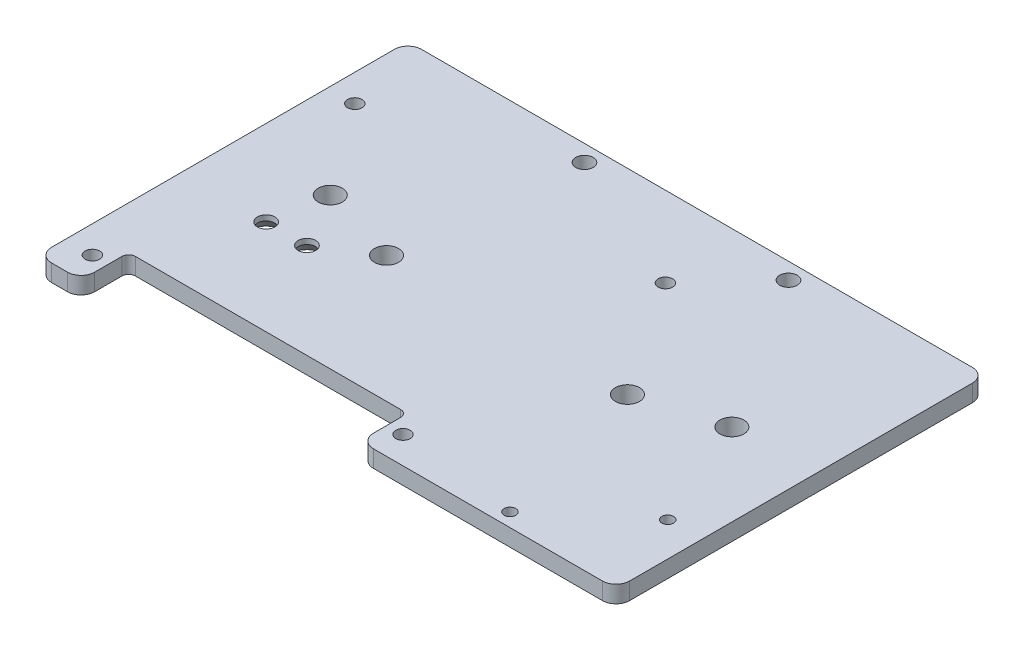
from build123d import *

# Parameters (mm, degrees)
SKETCH1_W                                     = 107.95
SKETCH1_H                                     = 69.088
BOSS_EXTRUDE1_DEPTH                           = 3.175
SKETCH2_R                                     = 1.63195
SKETCH2_R_2                                   = 1.35
SKETCH2_R_3                                   = 2.25
SKETCH2_R_4                                   = 0.635
SKETCH2_R_5                                   = 1.09
SKETCH2_W                                     = 52.070014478
SKETCH2_H                                     = 8.89
CUT_EXTRUDE1_DEPTH                            = 129.204660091
FILLET1_R                                     = 2.54
FILLET2_R                                     = 2.54
FILLET3_R                                     = 2.54
FILLET4_R                                     = 2.54
FILLET5_R                                     = 2.54
FILLET12_R                                    = 1.27
FILLET11_R                                    = 1.27
FILLET8_R                                     = 2.54
CSK_FOR_4_FLAT_HEAD_MACHINE_SCREW1_AT_2_COUNT = 2
CSK_FOR_4_FLAT_HEAD_MACHINE_SCREW1_AT_2_PITCH = 7.62
M4_CLEARANCE_HOLE1_D                          = 4.5


with BuildPart() as part:
    # Sketch1 → Boss-Extrude1 (new body)
    with BuildSketch(Plane(origin=(0, 0, 0), x_dir=(1, 0, 0), z_dir=(0, 1, 0))):
        with Locations((53.975, 34.544)):
            Rectangle(SKETCH1_W, SKETCH1_H)
    extrude(amount=BOSS_EXTRUDE1_DEPTH)

    # Sketch2 → Cut-Extrude1 (cut, through all)
    with BuildSketch(Plane.XZ):
        with Locations(Location((36.036250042, -66.013460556, 0), (0, 0, 270))):
            Circle(SKETCH2_R)
        with Locations(Location((74.136250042, -66.013460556, 0), (0, 0, 270))):
            Circle(SKETCH2_R)
        with Locations(Location((5.08, -5.08, 0), (0, 0, 270))):
            Circle(SKETCH2_R_2)
        with Locations(Location((63.080000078, -5.08, 0), (0, 0, 270))):
            Circle(SKETCH2_R_2)
        with Locations(Location((63.080000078, -54.080000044, 0), (0, 0, 270))):
            Circle(SKETCH2_R_2)
        with Locations(Location((5.08, -54.080000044, 0), (0, 0, 270))):
            Circle(SKETCH2_R_2)
        with Locations(Location((77.586250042, -32.490000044, 0), (0, 0, 270))):
            Circle(SKETCH2_R_3)
        with Locations(Location((32.586250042, -32.490000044, 0), (0, 0, 270))):
            Circle(SKETCH2_R_3)
        with Locations(Location((15.93230423, -26.67, 0), (0, 0, 270))):
            Circle(SKETCH2_R_4)
        with Locations(Location((23.55230423, -26.67, 0), (0, 0, 270))):
            Circle(SKETCH2_R_4)
        with Locations(Location((101.6, -16.002, 0), (0, 0, 270))):
            Circle(SKETCH2_R_5)
        with Locations(Location((85.598, -2.54, 0), (0, 0, 270))):
            Circle(SKETCH2_R_5)
        with Locations((34.080000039, -4.445)):
            Rectangle(SKETCH2_W, SKETCH2_H)
    extrude(amount=-CUT_EXTRUDE1_DEPTH, mode=Mode.SUBTRACT)

    # Fillet1
    fillet1_edges = [part.edges().sort_by_distance(p)[0] for p in [
        (0, 1.5875, 0),
    ]]
    fillet(fillet1_edges, radius=FILLET1_R)

    # Fillet2
    fillet2_edges = [part.edges().sort_by_distance(p)[0] for p in [
        (0, 1.5875, -69.088),
    ]]
    fillet(fillet2_edges, radius=FILLET2_R)

    # Fillet3
    fillet3_edges = [part.edges().sort_by_distance(p)[0] for p in [
        (107.95, 1.5875, -69.088),
    ]]
    fillet(fillet3_edges, radius=FILLET3_R)

    # Fillet4
    fillet4_edges = [part.edges().sort_by_distance(p)[0] for p in [
        (107.95, 1.5875, 0),
    ]]
    fillet(fillet4_edges, radius=FILLET4_R)

    # Fillet5
    fillet5_edges = [part.edges().sort_by_distance(p)[0] for p in [
        (60.115007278, 1.5875, 0),
    ]]
    fillet(fillet5_edges, radius=FILLET5_R)

    # Fillet12
    fillet12_edges = [part.edges().sort_by_distance(p)[0] for p in [
        (60.115007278, 1.5875, -8.89),
    ]]
    fillet(fillet12_edges, radius=FILLET12_R)

    # Fillet11
    fillet11_edges = [part.edges().sort_by_distance(p)[0] for p in [
        (8.0449928, 1.5875, -8.89),
    ]]
    fillet(fillet11_edges, radius=FILLET11_R)

    # Fillet8
    fillet8_edges = [part.edges().sort_by_distance(p)[0] for p in [
        (8.0449928, 1.5875, 0),
    ]]
    fillet(fillet8_edges, radius=FILLET8_R)

    # Sketch4 → CSK for _4 Flat Head Machine Screw1 (revolve, cut)
    with BuildSketch(Plane(origin=(23.55230423, 0, -26.67), x_dir=(0, 0, -1), z_dir=(1, 0, 0))):
        Polygon((0, 0), (0, 3.175), (1.63195, 3.175), (1.63195, 2.171845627), (3.5199066, 0), align=None)
    csk_for_4_flat_head_machine_screw1 = revolve(axis=Axis((23.55230423, -6.35, -26.67), (0, 1, 0)), mode=Mode.SUBTRACT)

    # CSK for _4 Flat Head Machine Screw1 at 2: CSK for _4 Flat Head Machine Screw1 ×2
    with Locations(*[(-i * CSK_FOR_4_FLAT_HEAD_MACHINE_SCREW1_AT_2_PITCH, 0, 0) for i in range(1, CSK_FOR_4_FLAT_HEAD_MACHINE_SCREW1_AT_2_COUNT)]):
        add(csk_for_4_flat_head_machine_screw1, mode=Mode.SUBTRACT)

    # M4 Clearance Hole1 (through all)
    with Locations(Plane(origin=(0, 0, 0), x_dir=(-1, 0, 0), z_dir=(0, -1, 0))):
        with Locations((-92.586250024, 36.991000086), (-17.586250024, 36.991000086)):
            Hole(M4_CLEARANCE_HOLE1_D / 2)


solid = part.part
